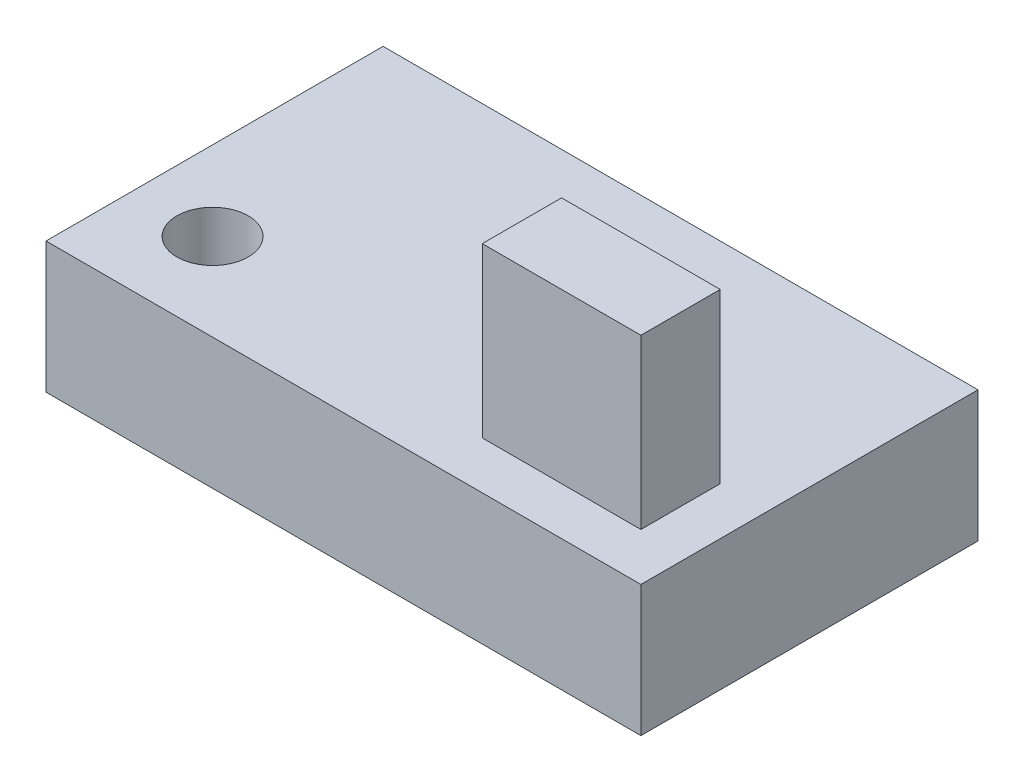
from build123d import *

# Parameters (mm, degrees)
SKETCH1_W           = 150
SKETCH1_H           = 85
BOSS_EXTRUDE1_DEPTH = 16.51
SKETCH2_W           = 40
SKETCH2_H           = 20
BOSS_EXTRUDE2_DEPTH = 42.418
SKETCH3_R           = 9
CUT_EXTRUDE1_DEPTH  = 15


with BuildPart() as part:
    # Sketch1 → Boss-Extrude1 (new, symmetric)
    with BuildSketch(Plane.XZ):
        Rectangle(SKETCH1_W, SKETCH1_H)
    extrude(amount=BOSS_EXTRUDE1_DEPTH, both=True)

    # Sketch2 → Boss-Extrude2 (add)
    with BuildSketch(Plane(origin=(0, 16.51, 0), x_dir=(1, 0, 0), z_dir=(0, 1, 0))):
        with Locations((43, -20.5)):
            Rectangle(SKETCH2_W, SKETCH2_H)
    extrude(amount=BOSS_EXTRUDE2_DEPTH)

    # Sketch3 → Cut-Extrude1 (cut)
    with BuildSketch(Plane(origin=(0, 16.51, 0), x_dir=(1, 0, 0), z_dir=(0, 1, 0))):
        with Locations(Location((-55, -20.5, 0), (0, 0, 270))):
            Circle(SKETCH3_R)
    extrude(amount=-CUT_EXTRUDE1_DEPTH, mode=Mode.SUBTRACT)


solid = part.part
